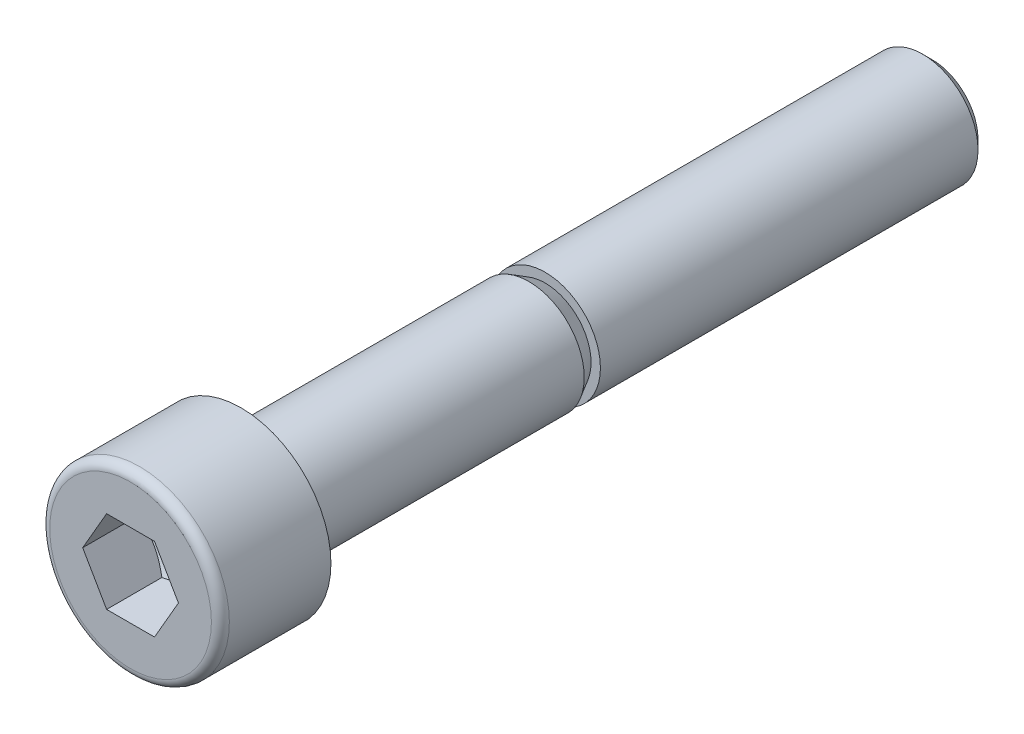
ISO-10303-21;
HEADER;
FILE_DESCRIPTION(('STEP AP214'),'2;1');
FILE_NAME('part.step','',(''),(''),'','','');
FILE_SCHEMA(('AUTOMOTIVE_DESIGN { 1 0 10303 214 1 1 1 1 }'));
ENDSEC;
DATA;
#1=APPLICATION_CONTEXT('core data for automotive mechanical design processes');
#2=APPLICATION_PROTOCOL_DEFINITION('international standard','automotive_design',2000,#1);
#3=PRODUCT_CONTEXT('',#1,'mechanical');
#4=PRODUCT('Part','Part','',(#3));
#5=PRODUCT_RELATED_PRODUCT_CATEGORY('part','',(#4));
#6=PRODUCT_DEFINITION_FORMATION('','',#4);
#7=PRODUCT_DEFINITION_CONTEXT('part definition',#1,'design');
#8=PRODUCT_DEFINITION('design','',#6,#7);
#9=PRODUCT_DEFINITION_SHAPE('','',#8);
#10=(LENGTH_UNIT() NAMED_UNIT(*) SI_UNIT(.MILLI.,.METRE.));
#11=(NAMED_UNIT(*) PLANE_ANGLE_UNIT() SI_UNIT($,.RADIAN.));
#12=(NAMED_UNIT(*) SI_UNIT($,.STERADIAN.) SOLID_ANGLE_UNIT());
#13=UNCERTAINTY_MEASURE_WITH_UNIT(LENGTH_MEASURE(1.E-05),#10,'distance_accuracy_value','');
#14=(GEOMETRIC_REPRESENTATION_CONTEXT(3) GLOBAL_UNCERTAINTY_ASSIGNED_CONTEXT((#13)) GLOBAL_UNIT_ASSIGNED_CONTEXT((#10,
#11,#12)) REPRESENTATION_CONTEXT('',''));
#15=CARTESIAN_POINT('',(0.,0.,0.));
#16=DIRECTION('',(0.,0.,1.));
#17=DIRECTION('',(1.,0.,0.));
#18=AXIS2_PLACEMENT_3D('',#15,#16,#17);
#19=CARTESIAN_POINT('',(0.,0.,8.));
#20=DIRECTION('',(0.,0.,1.));
#21=DIRECTION('',(1.,0.,0.));
#22=AXIS2_PLACEMENT_3D('',#19,#20,#21);
#23=PLANE('',#22);
#24=CARTESIAN_POINT('',(0.,0.,8.));
#25=DIRECTION('',(0.,0.,1.));
#26=DIRECTION('',(1.,0.,0.));
#27=AXIS2_PLACEMENT_3D('',#24,#25,#26);
#28=CIRCLE('',#27,5.85);
#29=CARTESIAN_POINT('',(5.85,0.,8.));
#30=VERTEX_POINT('',#29);
#31=EDGE_CURVE('E137',#30,#30,#28,.T.);
#32=ORIENTED_EDGE('',*,*,#31,.T.);
#33=EDGE_LOOP('',(#32));
#34=FACE_BOUND('',#33,.T.);
#35=DIRECTION('',(1.,0.,0.));
#36=VECTOR('',#35,1.);
#37=CARTESIAN_POINT('',(-1.73205,2.99999860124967,8.));
#38=LINE('',#37,#36);
#39=CARTESIAN_POINT('',(-1.73205,2.99999860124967,8.));
#40=VERTEX_POINT('',#39);
#41=CARTESIAN_POINT('',(1.73205,2.99999860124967,8.));
#42=VERTEX_POINT('',#41);
#43=EDGE_CURVE('E116',#40,#42,#38,.T.);
#44=ORIENTED_EDGE('',*,*,#43,.T.);
#45=DIRECTION('',(0.5,-0.866025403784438,0.));
#46=VECTOR('',#45,1.);
#47=CARTESIAN_POINT('',(1.73205,2.99999860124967,8.));
#48=LINE('',#47,#46);
#49=CARTESIAN_POINT('',(3.4641,0.,8.));
#50=VERTEX_POINT('',#49);
#51=EDGE_CURVE('E37',#42,#50,#48,.T.);
#52=ORIENTED_EDGE('',*,*,#51,.T.);
#53=DIRECTION('',(-0.5,-0.866025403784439,0.));
#54=VECTOR('',#53,1.);
#55=CARTESIAN_POINT('',(3.4641,0.,8.));
#56=LINE('',#55,#54);
#57=CARTESIAN_POINT('',(1.73205,-2.99999860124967,8.));
#58=VERTEX_POINT('',#57);
#59=EDGE_CURVE('E378',#50,#58,#56,.T.);
#60=ORIENTED_EDGE('',*,*,#59,.T.);
#61=DIRECTION('',(-1.,0.,0.));
#62=VECTOR('',#61,1.);
#63=CARTESIAN_POINT('',(1.73205,-2.99999860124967,8.));
#64=LINE('',#63,#62);
#65=CARTESIAN_POINT('',(-1.73205,-2.99999860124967,8.));
#66=VERTEX_POINT('',#65);
#67=EDGE_CURVE('E382',#58,#66,#64,.T.);
#68=ORIENTED_EDGE('',*,*,#67,.T.);
#69=DIRECTION('',(-0.5,0.866025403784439,0.));
#70=VECTOR('',#69,1.);
#71=CARTESIAN_POINT('',(-1.73205,-2.99999860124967,8.));
#72=LINE('',#71,#70);
#73=CARTESIAN_POINT('',(-3.4641,0.,8.));
#74=VERTEX_POINT('',#73);
#75=EDGE_CURVE('E386',#66,#74,#72,.T.);
#76=ORIENTED_EDGE('',*,*,#75,.T.);
#77=DIRECTION('',(0.5,0.866025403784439,0.));
#78=VECTOR('',#77,1.);
#79=CARTESIAN_POINT('',(-3.4641,0.,8.));
#80=LINE('',#79,#78);
#81=EDGE_CURVE('E122',#74,#40,#80,.T.);
#82=ORIENTED_EDGE('',*,*,#81,.T.);
#83=EDGE_LOOP('',(#44,#52,#60,#68,#76,#82));
#84=FACE_BOUND('',#83,.T.);
#85=ADVANCED_FACE('F16',(#34,#84),#23,.T.);
#86=CARTESIAN_POINT('',(0.,3.3234375,-50.));
#87=DIRECTION('',(0.,0.,-1.));
#88=DIRECTION('',(-1.,0.,0.));
#89=AXIS2_PLACEMENT_3D('',#86,#87,#88);
#90=PLANE('',#89);
#91=CARTESIAN_POINT('',(0.,0.,-50.));
#92=DIRECTION('',(0.,0.,1.));
#93=DIRECTION('',(1.,0.,0.));
#94=AXIS2_PLACEMENT_3D('',#91,#92,#93);
#95=CIRCLE('',#94,3.3234375);
#96=CARTESIAN_POINT('',(3.3234375,0.,-50.));
#97=VERTEX_POINT('',#96);
#98=EDGE_CURVE('E11',#97,#97,#95,.T.);
#99=ORIENTED_EDGE('',*,*,#98,.F.);
#100=EDGE_LOOP('',(#99));
#101=FACE_BOUND('',#100,.T.);
#102=ADVANCED_FACE('F18',(#101),#90,.T.);
#103=CARTESIAN_POINT('',(0.,0.,-49.3234375));
#104=DIRECTION('',(0.,0.,1.));
#105=DIRECTION('',(1.,0.,0.));
#106=AXIS2_PLACEMENT_3D('',#103,#104,#105);
#107=CONICAL_SURFACE('',#106,4.,0.785398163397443);
#108=ORIENTED_EDGE('',*,*,#98,.T.);
#109=EDGE_LOOP('',(#108));
#110=FACE_BOUND('',#109,.T.);
#111=CARTESIAN_POINT('',(0.,0.,-49.3234375));
#112=DIRECTION('',(0.,0.,1.));
#113=DIRECTION('',(1.,0.,0.));
#114=AXIS2_PLACEMENT_3D('',#111,#112,#113);
#115=CIRCLE('',#114,4.);
#116=CARTESIAN_POINT('',(4.,0.,-49.3234375));
#117=VERTEX_POINT('',#116);
#118=EDGE_CURVE('E25',#117,#117,#115,.T.);
#119=ORIENTED_EDGE('',*,*,#118,.F.);
#120=EDGE_LOOP('',(#119));
#121=FACE_BOUND('',#120,.T.);
#122=ADVANCED_FACE('F177',(#110,#121),#107,.T.);
#123=CARTESIAN_POINT('',(0.,0.,8.));
#124=DIRECTION('',(0.,0.,1.));
#125=DIRECTION('',(1.,0.,0.));
#126=AXIS2_PLACEMENT_3D('',#123,#124,#125);
#127=CYLINDRICAL_SURFACE('',#126,4.);
#128=ORIENTED_EDGE('',*,*,#118,.T.);
#129=EDGE_LOOP('',(#128));
#130=FACE_BOUND('',#129,.T.);
#131=CARTESIAN_POINT('',(0.,0.,-22.));
#132=DIRECTION('',(0.,0.,1.));
#133=DIRECTION('',(1.,0.,0.));
#134=AXIS2_PLACEMENT_3D('',#131,#132,#133);
#135=CIRCLE('',#134,4.);
#136=CARTESIAN_POINT('',(4.,0.,-22.));
#137=VERTEX_POINT('',#136);
#138=EDGE_CURVE('E164',#137,#137,#135,.T.);
#139=ORIENTED_EDGE('',*,*,#138,.F.);
#140=EDGE_LOOP('',(#139));
#141=FACE_BOUND('',#140,.T.);
#142=ADVANCED_FACE('F174',(#130,#141),#127,.T.);
#143=CARTESIAN_POINT('',(0.,3.3234375,-22.));
#144=DIRECTION('',(0.,0.,1.));
#145=DIRECTION('',(1.,0.,0.));
#146=AXIS2_PLACEMENT_3D('',#143,#144,#145);
#147=PLANE('',#146);
#148=ORIENTED_EDGE('',*,*,#138,.T.);
#149=EDGE_LOOP('',(#148));
#150=FACE_BOUND('',#149,.T.);
#151=CARTESIAN_POINT('',(0.,0.,-22.));
#152=DIRECTION('',(0.,0.,1.));
#153=DIRECTION('',(1.,0.,0.));
#154=AXIS2_PLACEMENT_3D('',#151,#152,#153);
#155=CIRCLE('',#154,3.3234375);
#156=CARTESIAN_POINT('',(3.3234375,0.,-22.));
#157=VERTEX_POINT('',#156);
#158=EDGE_CURVE('E160',#157,#157,#155,.T.);
#159=ORIENTED_EDGE('',*,*,#158,.F.);
#160=EDGE_LOOP('',(#159));
#161=FACE_BOUND('',#160,.T.);
#162=ADVANCED_FACE('F185',(#150,#161),#147,.T.);
#163=CARTESIAN_POINT('',(0.,0.,-20.8281593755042));
#164=DIRECTION('',(0.,0.,1.));
#165=DIRECTION('',(1.,0.,0.));
#166=AXIS2_PLACEMENT_3D('',#163,#164,#165);
#167=CONICAL_SURFACE('',#166,4.,0.523598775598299);
#168=ORIENTED_EDGE('',*,*,#158,.T.);
#169=EDGE_LOOP('',(#168));
#170=FACE_BOUND('',#169,.T.);
#171=CARTESIAN_POINT('',(0.,0.,-20.8281593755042));
#172=DIRECTION('',(0.,0.,1.));
#173=DIRECTION('',(1.,0.,0.));
#174=AXIS2_PLACEMENT_3D('',#171,#172,#173);
#175=CIRCLE('',#174,4.);
#176=CARTESIAN_POINT('',(4.,0.,-20.8281593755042));
#177=VERTEX_POINT('',#176);
#178=EDGE_CURVE('E156',#177,#177,#175,.T.);
#179=ORIENTED_EDGE('',*,*,#178,.F.);
#180=EDGE_LOOP('',(#179));
#181=FACE_BOUND('',#180,.T.);
#182=ADVANCED_FACE('F217',(#170,#181),#167,.T.);
#183=CARTESIAN_POINT('',(0.,0.,8.));
#184=DIRECTION('',(0.,0.,1.));
#185=DIRECTION('',(1.,0.,0.));
#186=AXIS2_PLACEMENT_3D('',#183,#184,#185);
#187=CYLINDRICAL_SURFACE('',#186,4.);
#188=ORIENTED_EDGE('',*,*,#178,.T.);
#189=EDGE_LOOP('',(#188));
#190=FACE_BOUND('',#189,.T.);
#191=CARTESIAN_POINT('',(0.,0.,-0.4));
#192=DIRECTION('',(0.,0.,1.));
#193=DIRECTION('',(1.,0.,0.));
#194=AXIS2_PLACEMENT_3D('',#191,#192,#193);
#195=CIRCLE('',#194,4.);
#196=CARTESIAN_POINT('',(4.,0.,-0.4));
#197=VERTEX_POINT('',#196);
#198=EDGE_CURVE('E152',#197,#197,#195,.T.);
#199=ORIENTED_EDGE('',*,*,#198,.F.);
#200=EDGE_LOOP('',(#199));
#201=FACE_BOUND('',#200,.T.);
#202=ADVANCED_FACE('F213',(#190,#201),#187,.T.);
#203=CARTESIAN_POINT('',(0.,0.,-0.4));
#204=DIRECTION('',(0.,0.,1.));
#205=DIRECTION('',(1.,0.,0.));
#206=AXIS2_PLACEMENT_3D('',#203,#204,#205);
#207=TOROIDAL_SURFACE('',#206,4.4,0.4);
#208=ORIENTED_EDGE('',*,*,#198,.T.);
#209=EDGE_LOOP('',(#208));
#210=FACE_BOUND('',#209,.T.);
#211=CARTESIAN_POINT('',(0.,0.,0.));
#212=DIRECTION('',(0.,0.,1.));
#213=DIRECTION('',(1.,0.,0.));
#214=AXIS2_PLACEMENT_3D('',#211,#212,#213);
#215=CIRCLE('',#214,4.4);
#216=CARTESIAN_POINT('',(4.4,0.,0.));
#217=VERTEX_POINT('',#216);
#218=EDGE_CURVE('E148',#217,#217,#215,.T.);
#219=ORIENTED_EDGE('',*,*,#218,.F.);
#220=EDGE_LOOP('',(#219));
#221=FACE_BOUND('',#220,.T.);
#222=ADVANCED_FACE('F209',(#210,#221),#207,.F.);
#223=CARTESIAN_POINT('',(0.,6.5,0.));
#224=DIRECTION('',(0.,0.,-1.));
#225=DIRECTION('',(-1.,0.,0.));
#226=AXIS2_PLACEMENT_3D('',#223,#224,#225);
#227=PLANE('',#226);
#228=ORIENTED_EDGE('',*,*,#218,.T.);
#229=EDGE_LOOP('',(#228));
#230=FACE_BOUND('',#229,.T.);
#231=CARTESIAN_POINT('',(0.,0.,0.));
#232=DIRECTION('',(0.,0.,1.));
#233=DIRECTION('',(1.,0.,0.));
#234=AXIS2_PLACEMENT_3D('',#231,#232,#233);
#235=CIRCLE('',#234,6.5);
#236=CARTESIAN_POINT('',(6.5,0.,0.));
#237=VERTEX_POINT('',#236);
#238=EDGE_CURVE('E144',#237,#237,#235,.T.);
#239=ORIENTED_EDGE('',*,*,#238,.F.);
#240=EDGE_LOOP('',(#239));
#241=FACE_BOUND('',#240,.T.);
#242=ADVANCED_FACE('F205',(#230,#241),#227,.T.);
#243=CARTESIAN_POINT('',(0.,0.,8.));
#244=DIRECTION('',(0.,0.,1.));
#245=DIRECTION('',(1.,0.,0.));
#246=AXIS2_PLACEMENT_3D('',#243,#244,#245);
#247=CYLINDRICAL_SURFACE('',#246,6.5);
#248=ORIENTED_EDGE('',*,*,#238,.T.);
#249=EDGE_LOOP('',(#248));
#250=FACE_BOUND('',#249,.T.);
#251=CARTESIAN_POINT('',(0.,0.,7.35));
#252=DIRECTION('',(0.,0.,1.));
#253=DIRECTION('',(1.,0.,0.));
#254=AXIS2_PLACEMENT_3D('',#251,#252,#253);
#255=CIRCLE('',#254,6.5);
#256=CARTESIAN_POINT('',(6.5,0.,7.35));
#257=VERTEX_POINT('',#256);
#258=EDGE_CURVE('E140',#257,#257,#255,.T.);
#259=ORIENTED_EDGE('',*,*,#258,.F.);
#260=EDGE_LOOP('',(#259));
#261=FACE_BOUND('',#260,.T.);
#262=ADVANCED_FACE('F201',(#250,#261),#247,.T.);
#263=CARTESIAN_POINT('',(0.,0.,7.35));
#264=DIRECTION('',(0.,0.,1.));
#265=DIRECTION('',(1.,0.,0.));
#266=AXIS2_PLACEMENT_3D('',#263,#264,#265);
#267=TOROIDAL_SURFACE('',#266,5.85,0.65);
#268=ORIENTED_EDGE('',*,*,#31,.F.);
#269=EDGE_LOOP('',(#268));
#270=FACE_BOUND('',#269,.T.);
#271=ORIENTED_EDGE('',*,*,#258,.T.);
#272=EDGE_LOOP('',(#271));
#273=FACE_BOUND('',#272,.T.);
#274=ADVANCED_FACE('F198',(#270,#273),#267,.T.);
#275=CARTESIAN_POINT('',(1.73205,2.99999860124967,2.00000093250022));
#276=DIRECTION('',(-0.866025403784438,-0.5,0.));
#277=DIRECTION('',(-0.5,0.866025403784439,0.));
#278=AXIS2_PLACEMENT_3D('',#275,#276,#277);
#279=PLANE('',#278);
#280=DIRECTION('',(0.,0.,1.));
#281=VECTOR('',#280,1.);
#282=CARTESIAN_POINT('',(3.4641,0.,2.00000093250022));
#283=LINE('',#282,#281);
#284=CARTESIAN_POINT('',(3.4641,0.,4.));
#285=VERTEX_POINT('',#284);
#286=EDGE_CURVE('E134',#285,#50,#283,.T.);
#287=ORIENTED_EDGE('',*,*,#286,.T.);
#288=ORIENTED_EDGE('',*,*,#51,.F.);
#289=DIRECTION('',(0.,0.,1.));
#290=VECTOR('',#289,1.);
#291=CARTESIAN_POINT('',(1.73205,2.99999860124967,2.00000093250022));
#292=LINE('',#291,#290);
#293=CARTESIAN_POINT('',(1.73205,2.99999860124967,4.));
#294=VERTEX_POINT('',#293);
#295=EDGE_CURVE('E109',#294,#42,#292,.T.);
#296=ORIENTED_EDGE('',*,*,#295,.F.);
#297=CARTESIAN_POINT('',(3.46410115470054,-2.E-06,4.000000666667));
#298=CARTESIAN_POINT('',(3.38798802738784,0.13182980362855,3.95604395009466));
#299=CARTESIAN_POINT('',(3.3112178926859,0.264799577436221,3.91606760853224));
#300=CARTESIAN_POINT('',(3.15634839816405,0.533041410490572,3.84629008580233));
#301=CARTESIAN_POINT('',(3.07824628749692,0.668318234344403,3.81651358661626));
#302=CARTESIAN_POINT('',(2.92300994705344,0.937195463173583,3.77016429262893));
#303=CARTESIAN_POINT('',(2.84589959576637,1.07075450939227,3.75328298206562));
#304=CARTESIAN_POINT('',(2.69131625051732,1.33850071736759,3.73313394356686));
#305=CARTESIAN_POINT('',(2.61384381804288,1.47268690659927,3.72984952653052));
#306=CARTESIAN_POINT('',(2.46909473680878,1.72339966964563,3.73669947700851));
#307=CARTESIAN_POINT('',(2.40179636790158,1.83996386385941,3.7451519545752));
#308=CARTESIAN_POINT('',(2.26763805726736,2.0723328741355,3.77193599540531));
#309=CARTESIAN_POINT('',(2.20077857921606,2.18813688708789,3.79027669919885));
#310=CARTESIAN_POINT('',(2.06634388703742,2.42098460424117,3.83612493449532));
#311=CARTESIAN_POINT('',(1.99878567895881,2.53799885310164,3.86382672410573));
#312=CARTESIAN_POINT('',(1.86467660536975,2.77028258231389,3.92669808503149));
#313=CARTESIAN_POINT('',(1.7981240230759,2.88555503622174,3.96185289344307));
#314=CARTESIAN_POINT('',(1.73204884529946,3.00000060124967,4.000000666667));
#315=B_SPLINE_CURVE_WITH_KNOTS('',3,(#297,#298,#299,#300,#301,#302,#303,#304,#305,#306,#307,
#308,#309,#310,#311,#312,#313,#314),.UNSPECIFIED.,.F.,.F.,(4,2,2,2,2,2,2,2,4),(0.,
0.475523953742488,0.952190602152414,1.41706121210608,1.88136106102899,2.28556223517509,
2.69013768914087,3.10368471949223,3.51642012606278),.UNSPECIFIED.);
#316=EDGE_CURVE('E101',#285,#294,#315,.T.);
#317=ORIENTED_EDGE('',*,*,#316,.F.);
#318=EDGE_LOOP('',(#287,#288,#296,#317));
#319=FACE_BOUND('',#318,.T.);
#320=ADVANCED_FACE('F110',(#319),#279,.T.);
#321=CARTESIAN_POINT('',(3.4641,0.,2.00000093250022));
#322=DIRECTION('',(-0.866025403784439,0.5,0.));
#323=DIRECTION('',(0.5,0.866025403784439,0.));
#324=AXIS2_PLACEMENT_3D('',#321,#322,#323);
#325=PLANE('',#324);
#326=DIRECTION('',(0.,0.,1.));
#327=VECTOR('',#326,1.);
#328=CARTESIAN_POINT('',(1.73205,-2.99999860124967,2.00000093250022));
#329=LINE('',#328,#327);
#330=CARTESIAN_POINT('',(1.73205,-2.99999860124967,4.));
#331=VERTEX_POINT('',#330);
#332=EDGE_CURVE('E131',#331,#58,#329,.T.);
#333=ORIENTED_EDGE('',*,*,#332,.T.);
#334=ORIENTED_EDGE('',*,*,#59,.F.);
#335=ORIENTED_EDGE('',*,*,#286,.F.);
#336=CARTESIAN_POINT('',(1.73204884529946,-3.00000060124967,4.000000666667));
#337=CARTESIAN_POINT('',(1.80816197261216,-2.86816879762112,3.95604395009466));
#338=CARTESIAN_POINT('',(1.8849321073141,-2.73519902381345,3.91606760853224));
#339=CARTESIAN_POINT('',(2.03980160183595,-2.4669571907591,3.84629008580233));
#340=CARTESIAN_POINT('',(2.11790371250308,-2.33168036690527,3.81651358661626));
#341=CARTESIAN_POINT('',(2.27314005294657,-2.06280313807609,3.77016429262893));
#342=CARTESIAN_POINT('',(2.35025040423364,-1.9292440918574,3.75328298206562));
#343=CARTESIAN_POINT('',(2.50483374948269,-1.66149788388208,3.73313394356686));
#344=CARTESIAN_POINT('',(2.58230618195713,-1.52731169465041,3.72984952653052));
#345=CARTESIAN_POINT('',(2.72705526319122,-1.27659893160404,3.73669947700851));
#346=CARTESIAN_POINT('',(2.79435363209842,-1.16003473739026,3.7451519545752));
#347=CARTESIAN_POINT('',(2.92851194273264,-0.927665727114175,3.77193599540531));
#348=CARTESIAN_POINT('',(2.99537142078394,-0.811861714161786,3.79027669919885));
#349=CARTESIAN_POINT('',(3.12980611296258,-0.579013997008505,3.83612493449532));
#350=CARTESIAN_POINT('',(3.1973643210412,-0.46199974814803,3.86382672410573));
#351=CARTESIAN_POINT('',(3.33147339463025,-0.229716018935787,3.92669808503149));
#352=CARTESIAN_POINT('',(3.3980259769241,-0.114443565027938,3.96185289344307));
#353=CARTESIAN_POINT('',(3.46410115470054,2.00000000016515E-06,4.000000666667));
#354=B_SPLINE_CURVE_WITH_KNOTS('',3,(#336,#337,#338,#339,#340,#341,#342,#343,#344,#345,#346,
#347,#348,#349,#350,#351,#352,#353),.UNSPECIFIED.,.F.,.F.,(4,2,2,2,2,2,2,2,4),(0.,
0.475523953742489,0.952190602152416,1.41706121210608,1.88136106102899,2.28556223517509,
2.69013768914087,3.10368471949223,3.51642012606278),.UNSPECIFIED.);
#355=EDGE_CURVE('E105',#331,#285,#354,.T.);
#356=ORIENTED_EDGE('',*,*,#355,.F.);
#357=EDGE_LOOP('',(#333,#334,#335,#356));
#358=FACE_BOUND('',#357,.T.);
#359=ADVANCED_FACE('F282',(#358),#325,.T.);
#360=CARTESIAN_POINT('',(1.73205,-2.99999860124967,2.00000093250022));
#361=DIRECTION('',(0.,1.,0.));
#362=DIRECTION('',(1.,0.,0.));
#363=AXIS2_PLACEMENT_3D('',#360,#361,#362);
#364=PLANE('',#363);
#365=DIRECTION('',(0.,0.,1.));
#366=VECTOR('',#365,1.);
#367=CARTESIAN_POINT('',(-1.73205,-2.99999860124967,2.00000093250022));
#368=LINE('',#367,#366);
#369=CARTESIAN_POINT('',(-1.73205,-2.99999860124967,4.));
#370=VERTEX_POINT('',#369);
#371=EDGE_CURVE('E128',#370,#66,#368,.T.);
#372=ORIENTED_EDGE('',*,*,#371,.T.);
#373=ORIENTED_EDGE('',*,*,#67,.F.);
#374=ORIENTED_EDGE('',*,*,#332,.F.);
#375=CARTESIAN_POINT('',(-4.48543327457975,-2.99999860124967,5.11550534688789));
#376=CARTESIAN_POINT('',(-4.35588300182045,-2.99999860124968,5.05335202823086));
#377=CARTESIAN_POINT('',(-4.22601712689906,-2.99999860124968,4.99184428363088));
#378=CARTESIAN_POINT('',(-3.9654859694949,-2.99999860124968,4.87048616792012));
#379=CARTESIAN_POINT('',(-3.8348205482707,-2.99999860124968,4.81063609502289));
#380=CARTESIAN_POINT('',(-3.57177288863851,-2.99999860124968,4.69262519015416));
#381=CARTESIAN_POINT('',(-3.43938504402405,-2.99999860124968,4.63447680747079));
#382=CARTESIAN_POINT('',(-3.17349843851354,-2.99999860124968,4.52078755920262));
#383=CARTESIAN_POINT('',(-3.03999973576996,-2.99999860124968,4.46524655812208));
#384=CARTESIAN_POINT('',(-2.768162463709,-2.99999860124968,4.356052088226));
#385=CARTESIAN_POINT('',(-2.6297886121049,-2.99999860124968,4.30248593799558));
#386=CARTESIAN_POINT('',(-2.35136718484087,-2.99999860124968,4.19980717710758));
#387=CARTESIAN_POINT('',(-2.21131941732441,-2.99999860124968,4.15069508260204));
#388=CARTESIAN_POINT('',(-1.92964461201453,-2.99999860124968,4.0583268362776));
#389=CARTESIAN_POINT('',(-1.78802198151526,-2.99999860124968,4.01505738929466));
#390=CARTESIAN_POINT('',(-1.5027595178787,-2.99999860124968,3.93586037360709));
#391=CARTESIAN_POINT('',(-1.35912038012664,-2.99999860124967,3.89993033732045));
#392=CARTESIAN_POINT('',(-1.07010555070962,-2.99999860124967,3.83732117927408));
#393=CARTESIAN_POINT('',(-0.924733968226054,-2.99999860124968,3.81062345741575));
#394=CARTESIAN_POINT('',(-0.632364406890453,-2.99999860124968,3.76822932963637));
#395=CARTESIAN_POINT('',(-0.485366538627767,-2.99999860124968,3.75253218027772));
#396=CARTESIAN_POINT('',(-0.192319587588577,-2.99999860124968,3.73359558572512));
#397=CARTESIAN_POINT('',(-0.0462802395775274,-2.99999860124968,3.7302091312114));
#398=CARTESIAN_POINT('',(0.245570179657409,-2.99999860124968,3.73580306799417));
#399=CARTESIAN_POINT('',(0.391381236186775,-2.99999860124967,3.74478422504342));
#400=CARTESIAN_POINT('',(0.643868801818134,-2.99999860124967,3.77043931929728));
#401=CARTESIAN_POINT('',(0.750824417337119,-2.99999860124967,3.78449289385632));
#402=CARTESIAN_POINT('',(0.963839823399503,-2.99999860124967,3.81828752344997));
#403=CARTESIAN_POINT('',(1.06989946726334,-2.99999860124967,3.83802949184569));
#404=CARTESIAN_POINT('',(1.3866523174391,-2.99999860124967,3.90473774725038));
#405=CARTESIAN_POINT('',(1.59578448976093,-2.99999860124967,3.95917098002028));
#406=CARTESIAN_POINT('',(1.90847464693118,-2.99999860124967,4.05215904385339));
#407=CARTESIAN_POINT('',(2.01368123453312,-2.99999860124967,4.08547388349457));
#408=CARTESIAN_POINT('',(2.2230712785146,-2.99999860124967,4.15520553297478));
#409=CARTESIAN_POINT('',(2.32725472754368,-2.99999860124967,4.19162236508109));
#410=CARTESIAN_POINT('',(2.5346401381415,-2.99999860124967,4.26700365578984));
#411=CARTESIAN_POINT('',(2.63784247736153,-2.99999860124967,4.30596708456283));
#412=CARTESIAN_POINT('',(2.84341531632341,-2.99999860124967,4.38601920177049));
#413=CARTESIAN_POINT('',(2.94578582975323,-2.99999860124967,4.42710785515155));
#414=CARTESIAN_POINT('',(3.20709884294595,-2.99999860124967,4.53462485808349));
#415=CARTESIAN_POINT('',(3.36551842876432,-2.99999860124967,4.60232247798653));
#416=CARTESIAN_POINT('',(3.68093034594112,-2.99999860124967,4.74097446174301));
#417=CARTESIAN_POINT('',(3.83792256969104,-2.99999860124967,4.81192906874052));
#418=CARTESIAN_POINT('',(4.15078503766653,-2.99999860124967,4.95636011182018));
#419=CARTESIAN_POINT('',(4.30665500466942,-2.99999860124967,5.02983714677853));
#420=CARTESIAN_POINT('',(4.61745618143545,-2.99999860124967,5.17875357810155));
#421=CARTESIAN_POINT('',(4.77238737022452,-2.99999860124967,5.25419301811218));
#422=CARTESIAN_POINT('',(5.23640418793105,-2.99999860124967,5.48299928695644));
#423=CARTESIAN_POINT('',(5.54434659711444,-2.99999860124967,5.63868235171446));
#424=CARTESIAN_POINT('',(6.15811770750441,-2.99999860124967,5.95402735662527));
#425=CARTESIAN_POINT('',(6.46394670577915,-2.99999860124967,6.11368872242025));
#426=CARTESIAN_POINT('',(7.04534872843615,-2.99999860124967,6.42057520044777));
#427=CARTESIAN_POINT('',(7.32105311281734,-2.99999860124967,6.5675518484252));
#428=CARTESIAN_POINT('',(7.8715766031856,-2.99999860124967,6.86317929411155));
#429=CARTESIAN_POINT('',(8.14639567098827,-2.99999860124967,7.01183016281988));
#430=CARTESIAN_POINT('',(8.69465235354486,-2.99999860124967,7.31000721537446));
#431=CARTESIAN_POINT('',(8.96809170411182,-2.99999860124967,7.45953021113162));
#432=CARTESIAN_POINT('',(9.51441609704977,-2.99999860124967,7.75954857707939));
#433=CARTESIAN_POINT('',(9.7873011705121,-2.99999860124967,7.9100438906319));
#434=CARTESIAN_POINT('',(10.0599876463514,-2.99999860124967,8.06089588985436));
#435=B_SPLINE_CURVE_WITH_KNOTS('',3,(#375,#376,#377,#378,#379,#380,#381,#382,#383,#384,#385,
#386,#387,#388,#389,#390,#391,#392,#393,#394,#395,#396,#397,#398,#399,#400,#401,#402,#403,#404,
#405,#406,#407,#408,#409,#410,#411,#412,#413,#414,#415,#416,#417,#418,#419,#420,#421,#422,#423,
#424,#425,#426,#427,#428,#429,#430,#431,#432,#433,#434),.UNSPECIFIED.,.F.,.F.,(4,2,2,2,2,2,2,2,
2,2,2,2,2,2,2,2,2,2,2,2,2,2,2,2,2,2,2,2,2,4),(0.,0.431070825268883,0.862218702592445,
1.29598193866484,1.72972260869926,2.17480373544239,2.6199363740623,3.0640383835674,
3.50799083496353,3.95104358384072,4.39406638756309,4.83178108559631,5.2695228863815,
5.59298785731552,5.91650479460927,6.56394435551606,6.89498708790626,7.2260321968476,
7.55694425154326,7.88785084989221,8.40463219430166,8.92145218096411,9.43839573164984,
9.9553507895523,10.9904747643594,12.0254501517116,12.9627445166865,13.9000787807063,
14.8350289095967,15.7699250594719),.UNSPECIFIED.);
#436=EDGE_CURVE('E343',#370,#331,#435,.T.);
#437=ORIENTED_EDGE('',*,*,#436,.F.);
#438=EDGE_LOOP('',(#372,#373,#374,#437));
#439=FACE_BOUND('',#438,.T.);
#440=ADVANCED_FACE('F289',(#439),#364,.T.);
#441=CARTESIAN_POINT('',(-1.73205,-2.99999860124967,2.00000093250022));
#442=DIRECTION('',(0.866025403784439,0.5,0.));
#443=DIRECTION('',(0.5,-0.866025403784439,0.));
#444=AXIS2_PLACEMENT_3D('',#441,#442,#443);
#445=PLANE('',#444);
#446=DIRECTION('',(0.,0.,1.));
#447=VECTOR('',#446,1.);
#448=CARTESIAN_POINT('',(-3.4641,0.,2.00000093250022));
#449=LINE('',#448,#447);
#450=CARTESIAN_POINT('',(-3.4641,0.,4.));
#451=VERTEX_POINT('',#450);
#452=EDGE_CURVE('E119',#451,#74,#449,.T.);
#453=ORIENTED_EDGE('',*,*,#452,.T.);
#454=ORIENTED_EDGE('',*,*,#75,.F.);
#455=ORIENTED_EDGE('',*,*,#371,.F.);
#456=CARTESIAN_POINT('',(-3.46410115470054,2.E-06,4.000000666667));
#457=CARTESIAN_POINT('',(-3.38798802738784,-0.131829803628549,3.95604395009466));
#458=CARTESIAN_POINT('',(-3.3112178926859,-0.26479957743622,3.91606760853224));
#459=CARTESIAN_POINT('',(-3.15634839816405,-0.533041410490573,3.84629008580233));
#460=CARTESIAN_POINT('',(-3.07824628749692,-0.668318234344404,3.81651358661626));
#461=CARTESIAN_POINT('',(-2.92300994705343,-0.937195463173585,3.77016429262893));
#462=CARTESIAN_POINT('',(-2.84589959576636,-1.07075450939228,3.75328298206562));
#463=CARTESIAN_POINT('',(-2.69131625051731,-1.33850071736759,3.73313394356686));
#464=CARTESIAN_POINT('',(-2.61384381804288,-1.47268690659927,3.72984952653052));
#465=CARTESIAN_POINT('',(-2.46909473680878,-1.72339966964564,3.73669947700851));
#466=CARTESIAN_POINT('',(-2.40179636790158,-1.83996386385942,3.7451519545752));
#467=CARTESIAN_POINT('',(-2.26763805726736,-2.0723328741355,3.77193599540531));
#468=CARTESIAN_POINT('',(-2.20077857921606,-2.18813688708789,3.79027669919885));
#469=CARTESIAN_POINT('',(-2.06634388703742,-2.42098460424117,3.83612493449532));
#470=CARTESIAN_POINT('',(-1.9987856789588,-2.53799885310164,3.86382672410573));
#471=CARTESIAN_POINT('',(-1.86467660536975,-2.77028258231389,3.92669808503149));
#472=CARTESIAN_POINT('',(-1.7981240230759,-2.88555503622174,3.96185289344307));
#473=CARTESIAN_POINT('',(-1.73204884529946,-3.00000060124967,4.000000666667));
#474=B_SPLINE_CURVE_WITH_KNOTS('',3,(#456,#457,#458,#459,#460,#461,#462,#463,#464,#465,#466,
#467,#468,#469,#470,#471,#472,#473),.UNSPECIFIED.,.F.,.F.,(4,2,2,2,2,2,2,2,4),(0.,
0.47552395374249,0.952190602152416,1.41706121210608,1.88136106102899,2.28556223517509,
2.69013768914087,3.10368471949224,3.51642012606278),.UNSPECIFIED.);
#475=EDGE_CURVE('E339',#451,#370,#474,.T.);
#476=ORIENTED_EDGE('',*,*,#475,.F.);
#477=EDGE_LOOP('',(#453,#454,#455,#476));
#478=FACE_BOUND('',#477,.T.);
#479=ADVANCED_FACE('F297',(#478),#445,.T.);
#480=CARTESIAN_POINT('',(-3.4641,0.,2.00000093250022));
#481=DIRECTION('',(0.866025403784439,-0.5,0.));
#482=DIRECTION('',(-0.5,-0.866025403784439,0.));
#483=AXIS2_PLACEMENT_3D('',#480,#481,#482);
#484=PLANE('',#483);
#485=DIRECTION('',(0.,0.,1.));
#486=VECTOR('',#485,1.);
#487=CARTESIAN_POINT('',(-1.73205,2.99999860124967,2.00000093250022));
#488=LINE('',#487,#486);
#489=CARTESIAN_POINT('',(-1.73205,2.99999860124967,4.));
#490=VERTEX_POINT('',#489);
#491=EDGE_CURVE('E115',#490,#40,#488,.T.);
#492=ORIENTED_EDGE('',*,*,#491,.T.);
#493=ORIENTED_EDGE('',*,*,#81,.F.);
#494=ORIENTED_EDGE('',*,*,#452,.F.);
#495=CARTESIAN_POINT('',(-1.73204884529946,3.00000060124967,4.000000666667));
#496=CARTESIAN_POINT('',(-1.80816197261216,2.86816879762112,3.95604395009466));
#497=CARTESIAN_POINT('',(-1.8849321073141,2.73519902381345,3.91606760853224));
#498=CARTESIAN_POINT('',(-2.03980160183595,2.4669571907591,3.84629008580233));
#499=CARTESIAN_POINT('',(-2.11790371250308,2.33168036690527,3.81651358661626));
#500=CARTESIAN_POINT('',(-2.27314005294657,2.06280313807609,3.77016429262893));
#501=CARTESIAN_POINT('',(-2.35025040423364,1.9292440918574,3.75328298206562));
#502=CARTESIAN_POINT('',(-2.50483374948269,1.66149788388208,3.73313394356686));
#503=CARTESIAN_POINT('',(-2.58230618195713,1.52731169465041,3.72984952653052));
#504=CARTESIAN_POINT('',(-2.72705526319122,1.27659893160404,3.73669947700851));
#505=CARTESIAN_POINT('',(-2.79435363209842,1.16003473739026,3.7451519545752));
#506=CARTESIAN_POINT('',(-2.92851194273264,0.927665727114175,3.77193599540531));
#507=CARTESIAN_POINT('',(-2.99537142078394,0.811861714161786,3.79027669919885));
#508=CARTESIAN_POINT('',(-3.12980611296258,0.579013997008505,3.83612493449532));
#509=CARTESIAN_POINT('',(-3.1973643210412,0.46199974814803,3.86382672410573));
#510=CARTESIAN_POINT('',(-3.33147339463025,0.229716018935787,3.92669808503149));
#511=CARTESIAN_POINT('',(-3.3980259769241,0.114443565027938,3.96185289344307));
#512=CARTESIAN_POINT('',(-3.46410115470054,-1.9999999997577E-06,4.000000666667));
#513=B_SPLINE_CURVE_WITH_KNOTS('',3,(#495,#496,#497,#498,#499,#500,#501,#502,#503,#504,#505,
#506,#507,#508,#509,#510,#511,#512),.UNSPECIFIED.,.F.,.F.,(4,2,2,2,2,2,2,2,4),(0.,
0.47552395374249,0.952190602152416,1.41706121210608,1.88136106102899,2.28556223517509,
2.69013768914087,3.10368471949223,3.51642012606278),.UNSPECIFIED.);
#514=EDGE_CURVE('E49',#490,#451,#513,.T.);
#515=ORIENTED_EDGE('',*,*,#514,.F.);
#516=EDGE_LOOP('',(#492,#493,#494,#515));
#517=FACE_BOUND('',#516,.T.);
#518=ADVANCED_FACE('F306',(#517),#484,.T.);
#519=CARTESIAN_POINT('',(-1.73205,2.99999860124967,2.00000093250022));
#520=DIRECTION('',(0.,-1.,0.));
#521=DIRECTION('',(-1.,0.,0.));
#522=AXIS2_PLACEMENT_3D('',#519,#520,#521);
#523=PLANE('',#522);
#524=ORIENTED_EDGE('',*,*,#295,.T.);
#525=ORIENTED_EDGE('',*,*,#43,.F.);
#526=ORIENTED_EDGE('',*,*,#491,.F.);
#527=CARTESIAN_POINT('',(-4.48543327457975,2.99999860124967,5.11550534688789));
#528=CARTESIAN_POINT('',(-4.35588300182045,2.99999860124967,5.05335202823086));
#529=CARTESIAN_POINT('',(-4.22601712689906,2.99999860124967,4.99184428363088));
#530=CARTESIAN_POINT('',(-3.96548596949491,2.99999860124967,4.87048616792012));
#531=CARTESIAN_POINT('',(-3.8348205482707,2.99999860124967,4.81063609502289));
#532=CARTESIAN_POINT('',(-3.57177288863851,2.99999860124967,4.69262519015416));
#533=CARTESIAN_POINT('',(-3.43938504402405,2.99999860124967,4.63447680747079));
#534=CARTESIAN_POINT('',(-3.17349843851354,2.99999860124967,4.52078755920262));
#535=CARTESIAN_POINT('',(-3.03999973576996,2.99999860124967,4.46524655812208));
#536=CARTESIAN_POINT('',(-2.768162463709,2.99999860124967,4.356052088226));
#537=CARTESIAN_POINT('',(-2.62978861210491,2.99999860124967,4.30248593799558));
#538=CARTESIAN_POINT('',(-2.35136718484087,2.99999860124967,4.19980717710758));
#539=CARTESIAN_POINT('',(-2.21131941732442,2.99999860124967,4.15069508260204));
#540=CARTESIAN_POINT('',(-1.92964461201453,2.99999860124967,4.0583268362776));
#541=CARTESIAN_POINT('',(-1.78802198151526,2.99999860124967,4.01505738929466));
#542=CARTESIAN_POINT('',(-1.5027595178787,2.99999860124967,3.93586037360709));
#543=CARTESIAN_POINT('',(-1.35912038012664,2.99999860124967,3.89993033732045));
#544=CARTESIAN_POINT('',(-1.07010555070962,2.99999860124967,3.83732117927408));
#545=CARTESIAN_POINT('',(-0.924733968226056,2.99999860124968,3.81062345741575));
#546=CARTESIAN_POINT('',(-0.632364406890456,2.99999860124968,3.76822932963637));
#547=CARTESIAN_POINT('',(-0.48536653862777,2.99999860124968,3.75253218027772));
#548=CARTESIAN_POINT('',(-0.19231958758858,2.99999860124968,3.73359558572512));
#549=CARTESIAN_POINT('',(-0.0462802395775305,2.99999860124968,3.7302091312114));
#550=CARTESIAN_POINT('',(0.245570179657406,2.99999860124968,3.73580306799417));
#551=CARTESIAN_POINT('',(0.391381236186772,2.99999860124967,3.74478422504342));
#552=CARTESIAN_POINT('',(0.64386880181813,2.99999860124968,3.77043931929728));
#553=CARTESIAN_POINT('',(0.750824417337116,2.99999860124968,3.78449289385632));
#554=CARTESIAN_POINT('',(0.9638398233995,2.99999860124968,3.81828752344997));
#555=CARTESIAN_POINT('',(1.06989946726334,2.99999860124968,3.83802949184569));
#556=CARTESIAN_POINT('',(1.3866523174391,2.99999860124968,3.90473774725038));
#557=CARTESIAN_POINT('',(1.59578448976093,2.99999860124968,3.95917098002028));
#558=CARTESIAN_POINT('',(1.90847464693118,2.99999860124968,4.05215904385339));
#559=CARTESIAN_POINT('',(2.01368123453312,2.99999860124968,4.08547388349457));
#560=CARTESIAN_POINT('',(2.2230712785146,2.99999860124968,4.15520553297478));
#561=CARTESIAN_POINT('',(2.32725472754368,2.99999860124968,4.19162236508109));
#562=CARTESIAN_POINT('',(2.5346401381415,2.99999860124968,4.26700365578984));
#563=CARTESIAN_POINT('',(2.63784247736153,2.99999860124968,4.30596708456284));
#564=CARTESIAN_POINT('',(2.84341531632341,2.99999860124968,4.38601920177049));
#565=CARTESIAN_POINT('',(2.94578582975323,2.99999860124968,4.42710785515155));
#566=CARTESIAN_POINT('',(3.20709884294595,2.99999860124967,4.53462485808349));
#567=CARTESIAN_POINT('',(3.36551842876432,2.99999860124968,4.60232247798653));
#568=CARTESIAN_POINT('',(3.68093034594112,2.99999860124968,4.74097446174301));
#569=CARTESIAN_POINT('',(3.83792256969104,2.99999860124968,4.81192906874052));
#570=CARTESIAN_POINT('',(4.15078503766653,2.99999860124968,4.95636011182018));
#571=CARTESIAN_POINT('',(4.30665500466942,2.99999860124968,5.02983714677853));
#572=CARTESIAN_POINT('',(4.61745618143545,2.99999860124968,5.17875357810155));
#573=CARTESIAN_POINT('',(4.77238737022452,2.99999860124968,5.25419301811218));
#574=CARTESIAN_POINT('',(5.23640418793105,2.99999860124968,5.48299928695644));
#575=CARTESIAN_POINT('',(5.54434659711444,2.99999860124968,5.63868235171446));
#576=CARTESIAN_POINT('',(6.15811770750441,2.99999860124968,5.95402735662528));
#577=CARTESIAN_POINT('',(6.46394670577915,2.99999860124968,6.11368872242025));
#578=CARTESIAN_POINT('',(7.04534872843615,2.99999860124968,6.42057520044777));
#579=CARTESIAN_POINT('',(7.32105311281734,2.99999860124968,6.5675518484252));
#580=CARTESIAN_POINT('',(7.87157660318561,2.99999860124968,6.86317929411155));
#581=CARTESIAN_POINT('',(8.14639567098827,2.99999860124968,7.01183016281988));
#582=CARTESIAN_POINT('',(8.69465235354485,2.99999860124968,7.31000721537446));
#583=CARTESIAN_POINT('',(8.96809170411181,2.99999860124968,7.45953021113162));
#584=CARTESIAN_POINT('',(9.51441609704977,2.99999860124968,7.75954857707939));
#585=CARTESIAN_POINT('',(9.7873011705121,2.99999860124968,7.9100438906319));
#586=CARTESIAN_POINT('',(10.0599876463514,2.99999860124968,8.06089588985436));
#587=B_SPLINE_CURVE_WITH_KNOTS('',3,(#527,#528,#529,#530,#531,#532,#533,#534,#535,#536,#537,
#538,#539,#540,#541,#542,#543,#544,#545,#546,#547,#548,#549,#550,#551,#552,#553,#554,#555,#556,
#557,#558,#559,#560,#561,#562,#563,#564,#565,#566,#567,#568,#569,#570,#571,#572,#573,#574,#575,
#576,#577,#578,#579,#580,#581,#582,#583,#584,#585,#586),.UNSPECIFIED.,.F.,.F.,(4,2,2,2,2,2,2,2,
2,2,2,2,2,2,2,2,2,2,2,2,2,2,2,2,2,2,2,2,2,4),(0.,0.431070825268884,0.862218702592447,
1.29598193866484,1.72972260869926,2.1748037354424,2.6199363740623,3.06403838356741,
3.50799083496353,3.95104358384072,4.39406638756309,4.83178108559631,5.2695228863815,
5.59298785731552,5.91650479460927,6.56394435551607,6.89498708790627,7.2260321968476,
7.55694425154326,7.88785084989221,8.40463219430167,8.92145218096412,9.43839573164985,
9.9553507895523,10.9904747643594,12.0254501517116,12.9627445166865,13.9000787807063,
14.8350289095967,15.7699250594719),.UNSPECIFIED.);
#588=EDGE_CURVE('E102',#294,#490,#587,.F.);
#589=ORIENTED_EDGE('',*,*,#588,.F.);
#590=EDGE_LOOP('',(#524,#525,#526,#589));
#591=FACE_BOUND('',#590,.T.);
#592=ADVANCED_FACE('F97',(#591),#523,.T.);
#593=CARTESIAN_POINT('',(0.,0.,2.00000093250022));
#594=DIRECTION('',(0.,0.,1.));
#595=DIRECTION('',(1.,0.,0.));
#596=AXIS2_PLACEMENT_3D('',#593,#594,#595);
#597=CONICAL_SURFACE('',#596,0.,1.0471975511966);
#598=CARTESIAN_POINT('',(0.,0.,2.00000093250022));
#599=VERTEX_POINT('',#598);
#600=VERTEX_LOOP('',#599);
#601=FACE_BOUND('',#600,.T.);
#602=ORIENTED_EDGE('',*,*,#316,.T.);
#603=ORIENTED_EDGE('',*,*,#588,.T.);
#604=ORIENTED_EDGE('',*,*,#514,.T.);
#605=ORIENTED_EDGE('',*,*,#475,.T.);
#606=ORIENTED_EDGE('',*,*,#436,.T.);
#607=ORIENTED_EDGE('',*,*,#355,.T.);
#608=EDGE_LOOP('',(#602,#603,#604,#605,#606,#607));
#609=FACE_BOUND('',#608,.T.);
#610=ADVANCED_FACE('F94',(#601,#609),#597,.F.);
#611=CLOSED_SHELL('',(#85,#102,#122,#142,#162,#182,#202,#222,#242,#262,#274,#320,#359,#440,#479,
#518,#592,#610));
#612=MANIFOLD_SOLID_BREP('B1',#611);
#613=ADVANCED_BREP_SHAPE_REPRESENTATION('',(#18,#612),#14);
#614=SHAPE_DEFINITION_REPRESENTATION(#9,#613);
ENDSEC;
END-ISO-10303-21;
